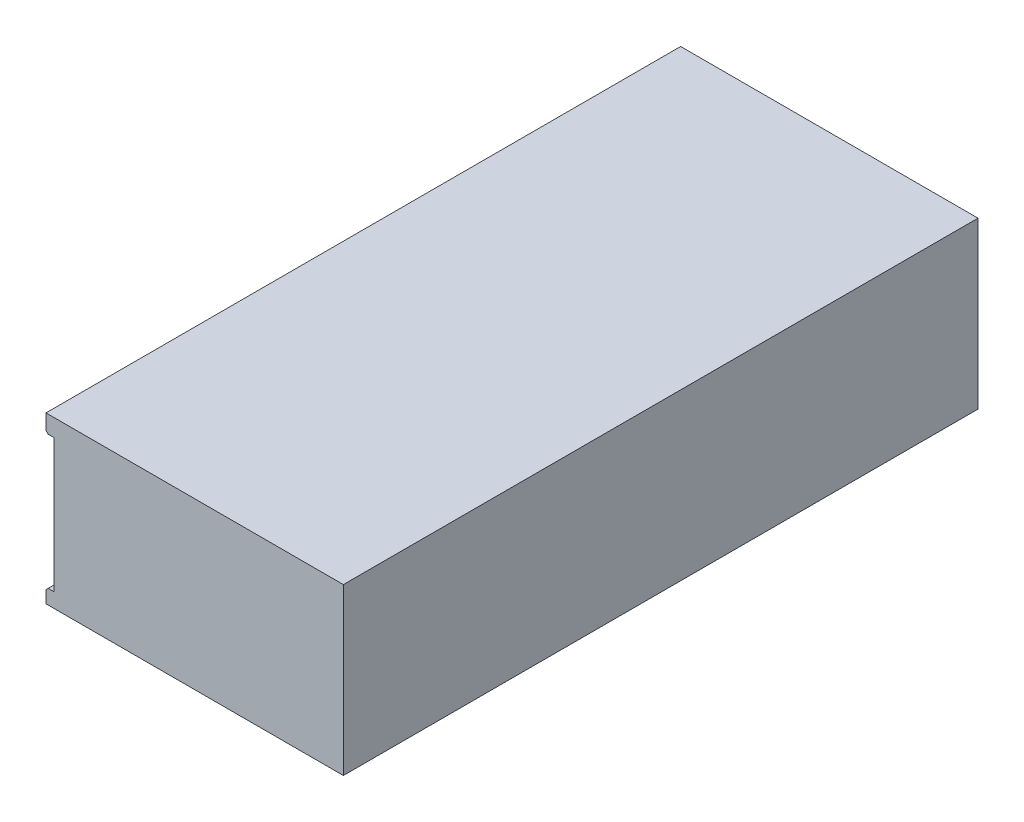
ISO-10303-21;
HEADER;
FILE_DESCRIPTION(('STEP AP214'),'2;1');
FILE_NAME('part.step','',(''),(''),'','','');
FILE_SCHEMA(('AUTOMOTIVE_DESIGN { 1 0 10303 214 1 1 1 1 }'));
ENDSEC;
DATA;
#1=APPLICATION_CONTEXT('core data for automotive mechanical design processes');
#2=APPLICATION_PROTOCOL_DEFINITION('international standard','automotive_design',2000,#1);
#3=PRODUCT_CONTEXT('',#1,'mechanical');
#4=PRODUCT('Part','Part','',(#3));
#5=PRODUCT_RELATED_PRODUCT_CATEGORY('part','',(#4));
#6=PRODUCT_DEFINITION_FORMATION('','',#4);
#7=PRODUCT_DEFINITION_CONTEXT('part definition',#1,'design');
#8=PRODUCT_DEFINITION('design','',#6,#7);
#9=PRODUCT_DEFINITION_SHAPE('','',#8);
#10=(LENGTH_UNIT() NAMED_UNIT(*) SI_UNIT(.MILLI.,.METRE.));
#11=(NAMED_UNIT(*) PLANE_ANGLE_UNIT() SI_UNIT($,.RADIAN.));
#12=(NAMED_UNIT(*) SI_UNIT($,.STERADIAN.) SOLID_ANGLE_UNIT());
#13=UNCERTAINTY_MEASURE_WITH_UNIT(LENGTH_MEASURE(1.E-05),#10,'distance_accuracy_value','');
#14=(GEOMETRIC_REPRESENTATION_CONTEXT(3) GLOBAL_UNCERTAINTY_ASSIGNED_CONTEXT((#13)) GLOBAL_UNIT_ASSIGNED_CONTEXT((#10,
#11,#12)) REPRESENTATION_CONTEXT('',''));
#15=CARTESIAN_POINT('',(0.,0.,0.));
#16=DIRECTION('',(0.,0.,1.));
#17=DIRECTION('',(1.,0.,0.));
#18=AXIS2_PLACEMENT_3D('',#15,#16,#17);
#19=CARTESIAN_POINT('',(-1.397,0.,55.5625));
#20=DIRECTION('',(0.,-1.,0.));
#21=DIRECTION('',(0.,0.,-1.));
#22=AXIS2_PLACEMENT_3D('',#19,#20,#21);
#23=PLANE('',#22);
#24=DIRECTION('',(-1.,0.,0.));
#25=VECTOR('',#24,1.);
#26=CARTESIAN_POINT('',(-1.397,0.,-55.5625));
#27=LINE('',#26,#25);
#28=CARTESIAN_POINT('',(50.673,0.,-55.5625));
#29=VERTEX_POINT('',#28);
#30=CARTESIAN_POINT('',(-1.397,0.,-55.5625));
#31=VERTEX_POINT('',#30);
#32=EDGE_CURVE('E240',#29,#31,#27,.T.);
#33=ORIENTED_EDGE('',*,*,#32,.T.);
#34=DIRECTION('',(0.,0.,-1.));
#35=VECTOR('',#34,1.);
#36=CARTESIAN_POINT('',(-1.397,0.,55.5625));
#37=LINE('',#36,#35);
#38=CARTESIAN_POINT('',(-1.397,0.,55.5625));
#39=VERTEX_POINT('',#38);
#40=EDGE_CURVE('E291',#39,#31,#37,.T.);
#41=ORIENTED_EDGE('',*,*,#40,.F.);
#42=DIRECTION('',(-1.,0.,0.));
#43=VECTOR('',#42,1.);
#44=CARTESIAN_POINT('',(-1.397,0.,55.5625));
#45=LINE('',#44,#43);
#46=CARTESIAN_POINT('',(50.673,0.,55.5625));
#47=VERTEX_POINT('',#46);
#48=EDGE_CURVE('E241',#47,#39,#45,.T.);
#49=ORIENTED_EDGE('',*,*,#48,.F.);
#50=DIRECTION('',(0.,0.,-1.));
#51=VECTOR('',#50,1.);
#52=CARTESIAN_POINT('',(50.673,0.,55.5625));
#53=LINE('',#52,#51);
#54=EDGE_CURVE('E260',#47,#29,#53,.T.);
#55=ORIENTED_EDGE('',*,*,#54,.T.);
#56=EDGE_LOOP('',(#33,#41,#49,#55));
#57=FACE_BOUND('',#56,.T.);
#58=ADVANCED_FACE('F37',(#57),#23,.F.);
#59=CARTESIAN_POINT('',(-1.397,-3.048,55.5625));
#60=DIRECTION('',(1.,0.,0.));
#61=DIRECTION('',(0.,0.,-1.));
#62=AXIS2_PLACEMENT_3D('',#59,#60,#61);
#63=PLANE('',#62);
#64=DIRECTION('',(0.,-1.,0.));
#65=VECTOR('',#64,1.);
#66=CARTESIAN_POINT('',(-1.397,-3.048,-55.5625));
#67=LINE('',#66,#65);
#68=CARTESIAN_POINT('',(-1.397,-2.66700000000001,-55.5625));
#69=VERTEX_POINT('',#68);
#70=EDGE_CURVE('E263',#31,#69,#67,.T.);
#71=ORIENTED_EDGE('',*,*,#70,.T.);
#72=DIRECTION('',(0.,0.,1.));
#73=VECTOR('',#72,1.);
#74=CARTESIAN_POINT('',(-1.397,-2.66700000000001,55.5625));
#75=LINE('',#74,#73);
#76=CARTESIAN_POINT('',(-1.397,-2.66700000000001,55.5625));
#77=VERTEX_POINT('',#76);
#78=EDGE_CURVE('E11',#69,#77,#75,.T.);
#79=ORIENTED_EDGE('',*,*,#78,.T.);
#80=DIRECTION('',(0.,-1.,0.));
#81=VECTOR('',#80,1.);
#82=CARTESIAN_POINT('',(-1.397,-3.048,55.5625));
#83=LINE('',#82,#81);
#84=EDGE_CURVE('E244',#39,#77,#83,.T.);
#85=ORIENTED_EDGE('',*,*,#84,.F.);
#86=ORIENTED_EDGE('',*,*,#40,.T.);
#87=EDGE_LOOP('',(#71,#79,#85,#86));
#88=FACE_BOUND('',#87,.T.);
#89=ADVANCED_FACE('F347',(#88),#63,.F.);
#90=CARTESIAN_POINT('',(0.,-3.048,55.5625));
#91=DIRECTION('',(0.,1.,0.));
#92=DIRECTION('',(0.,0.,1.));
#93=AXIS2_PLACEMENT_3D('',#90,#91,#92);
#94=PLANE('',#93);
#95=DIRECTION('',(1.,0.,0.));
#96=VECTOR('',#95,1.);
#97=CARTESIAN_POINT('',(0.,-3.048,55.5625));
#98=LINE('',#97,#96);
#99=CARTESIAN_POINT('',(-1.01600000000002,-3.048,55.5625));
#100=VERTEX_POINT('',#99);
#101=CARTESIAN_POINT('',(0.,-3.048,55.5625));
#102=VERTEX_POINT('',#101);
#103=EDGE_CURVE('E247',#100,#102,#98,.T.);
#104=ORIENTED_EDGE('',*,*,#103,.F.);
#105=DIRECTION('',(0.,0.,-1.));
#106=VECTOR('',#105,1.);
#107=CARTESIAN_POINT('',(-1.01600000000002,-3.048,55.5625));
#108=LINE('',#107,#106);
#109=CARTESIAN_POINT('',(-1.01600000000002,-3.048,-55.5625));
#110=VERTEX_POINT('',#109);
#111=EDGE_CURVE('E45',#100,#110,#108,.T.);
#112=ORIENTED_EDGE('',*,*,#111,.T.);
#113=DIRECTION('',(1.,0.,0.));
#114=VECTOR('',#113,1.);
#115=CARTESIAN_POINT('',(0.,-3.048,-55.5625));
#116=LINE('',#115,#114);
#117=CARTESIAN_POINT('',(0.,-3.048,-55.5625));
#118=VERTEX_POINT('',#117);
#119=EDGE_CURVE('E265',#110,#118,#116,.T.);
#120=ORIENTED_EDGE('',*,*,#119,.T.);
#121=DIRECTION('',(0.,0.,-1.));
#122=VECTOR('',#121,1.);
#123=CARTESIAN_POINT('',(0.,-3.048,55.5625));
#124=LINE('',#123,#122);
#125=EDGE_CURVE('E288',#102,#118,#124,.T.);
#126=ORIENTED_EDGE('',*,*,#125,.F.);
#127=EDGE_LOOP('',(#104,#112,#120,#126));
#128=FACE_BOUND('',#127,.T.);
#129=ADVANCED_FACE('F309',(#128),#94,.F.);
#130=CARTESIAN_POINT('',(0.,-26.416,55.5625));
#131=DIRECTION('',(1.,0.,0.));
#132=DIRECTION('',(0.,0.,-1.));
#133=AXIS2_PLACEMENT_3D('',#130,#131,#132);
#134=PLANE('',#133);
#135=CARTESIAN_POINT('',(0.,-6.34999999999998,-50.2666));
#136=DIRECTION('',(-1.,0.,0.));
#137=DIRECTION('',(0.,0.,1.));
#138=AXIS2_PLACEMENT_3D('',#135,#136,#137);
#139=CIRCLE('',#138,2.413);
#140=CARTESIAN_POINT('',(0.,-6.34999999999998,-47.8536));
#141=VERTEX_POINT('',#140);
#142=EDGE_CURVE('E153',#141,#141,#139,.T.);
#143=ORIENTED_EDGE('',*,*,#142,.F.);
#144=EDGE_LOOP('',(#143));
#145=FACE_BOUND('',#144,.T.);
#146=CARTESIAN_POINT('',(0.,-6.35000000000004,50.2666));
#147=DIRECTION('',(-1.,0.,0.));
#148=DIRECTION('',(0.,0.,1.));
#149=AXIS2_PLACEMENT_3D('',#146,#147,#148);
#150=CIRCLE('',#149,2.413);
#151=CARTESIAN_POINT('',(0.,-6.35000000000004,52.6796));
#152=VERTEX_POINT('',#151);
#153=EDGE_CURVE('E165',#152,#152,#150,.T.);
#154=ORIENTED_EDGE('',*,*,#153,.F.);
#155=EDGE_LOOP('',(#154));
#156=FACE_BOUND('',#155,.T.);
#157=CARTESIAN_POINT('',(0.,-6.35000000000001,4.8768));
#158=DIRECTION('',(-1.,0.,0.));
#159=DIRECTION('',(0.,0.,1.));
#160=AXIS2_PLACEMENT_3D('',#157,#158,#159);
#161=CIRCLE('',#160,2.413);
#162=CARTESIAN_POINT('',(0.,-6.35000000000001,7.28979999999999));
#163=VERTEX_POINT('',#162);
#164=EDGE_CURVE('E177',#163,#163,#161,.T.);
#165=ORIENTED_EDGE('',*,*,#164,.F.);
#166=EDGE_LOOP('',(#165));
#167=FACE_BOUND('',#166,.T.);
#168=CARTESIAN_POINT('',(0.,-6.35000000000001,-4.8768));
#169=DIRECTION('',(-1.,0.,0.));
#170=DIRECTION('',(0.,0.,1.));
#171=AXIS2_PLACEMENT_3D('',#168,#169,#170);
#172=CIRCLE('',#171,2.413);
#173=CARTESIAN_POINT('',(0.,-6.35000000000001,-2.4638));
#174=VERTEX_POINT('',#173);
#175=EDGE_CURVE('E189',#174,#174,#172,.T.);
#176=ORIENTED_EDGE('',*,*,#175,.F.);
#177=EDGE_LOOP('',(#176));
#178=FACE_BOUND('',#177,.T.);
#179=CARTESIAN_POINT('',(0.,-23.114,-50.2666));
#180=DIRECTION('',(-1.,0.,0.));
#181=DIRECTION('',(0.,0.,1.));
#182=AXIS2_PLACEMENT_3D('',#179,#180,#181);
#183=CIRCLE('',#182,2.413);
#184=CARTESIAN_POINT('',(0.,-23.114,-47.8536));
#185=VERTEX_POINT('',#184);
#186=EDGE_CURVE('E201',#185,#185,#183,.T.);
#187=ORIENTED_EDGE('',*,*,#186,.F.);
#188=EDGE_LOOP('',(#187));
#189=FACE_BOUND('',#188,.T.);
#190=CARTESIAN_POINT('',(0.,-23.114,-4.87680000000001));
#191=DIRECTION('',(-1.,0.,0.));
#192=DIRECTION('',(0.,0.,1.));
#193=AXIS2_PLACEMENT_3D('',#190,#191,#192);
#194=CIRCLE('',#193,2.413);
#195=CARTESIAN_POINT('',(0.,-23.114,-2.46380000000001));
#196=VERTEX_POINT('',#195);
#197=EDGE_CURVE('E213',#196,#196,#194,.T.);
#198=ORIENTED_EDGE('',*,*,#197,.F.);
#199=EDGE_LOOP('',(#198));
#200=FACE_BOUND('',#199,.T.);
#201=CARTESIAN_POINT('',(0.,-23.114,4.87679999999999));
#202=DIRECTION('',(-1.,0.,0.));
#203=DIRECTION('',(0.,0.,1.));
#204=AXIS2_PLACEMENT_3D('',#201,#202,#203);
#205=CIRCLE('',#204,2.413);
#206=CARTESIAN_POINT('',(0.,-23.114,7.28979999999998));
#207=VERTEX_POINT('',#206);
#208=EDGE_CURVE('E225',#207,#207,#205,.T.);
#209=ORIENTED_EDGE('',*,*,#208,.F.);
#210=EDGE_LOOP('',(#209));
#211=FACE_BOUND('',#210,.T.);
#212=CARTESIAN_POINT('',(0.,-23.114,50.2666));
#213=DIRECTION('',(-1.,0.,0.));
#214=DIRECTION('',(0.,0.,1.));
#215=AXIS2_PLACEMENT_3D('',#212,#213,#214);
#216=CIRCLE('',#215,2.413);
#217=CARTESIAN_POINT('',(0.,-23.114,52.6796));
#218=VERTEX_POINT('',#217);
#219=EDGE_CURVE('E237',#218,#218,#216,.T.);
#220=ORIENTED_EDGE('',*,*,#219,.F.);
#221=EDGE_LOOP('',(#220));
#222=FACE_BOUND('',#221,.T.);
#223=DIRECTION('',(0.,-1.,0.));
#224=VECTOR('',#223,1.);
#225=CARTESIAN_POINT('',(0.,-26.416,-55.5625));
#226=LINE('',#225,#224);
#227=CARTESIAN_POINT('',(0.,-26.416,-55.5625));
#228=VERTEX_POINT('',#227);
#229=EDGE_CURVE('E267',#118,#228,#226,.T.);
#230=ORIENTED_EDGE('',*,*,#229,.T.);
#231=DIRECTION('',(0.,0.,-1.));
#232=VECTOR('',#231,1.);
#233=CARTESIAN_POINT('',(0.,-26.416,55.5625));
#234=LINE('',#233,#232);
#235=CARTESIAN_POINT('',(0.,-26.416,55.5625));
#236=VERTEX_POINT('',#235);
#237=EDGE_CURVE('E285',#236,#228,#234,.T.);
#238=ORIENTED_EDGE('',*,*,#237,.F.);
#239=DIRECTION('',(0.,-1.,0.));
#240=VECTOR('',#239,1.);
#241=CARTESIAN_POINT('',(0.,-26.416,55.5625));
#242=LINE('',#241,#240);
#243=EDGE_CURVE('E249',#102,#236,#242,.T.);
#244=ORIENTED_EDGE('',*,*,#243,.F.);
#245=ORIENTED_EDGE('',*,*,#125,.T.);
#246=EDGE_LOOP('',(#230,#238,#244,#245));
#247=FACE_BOUND('',#246,.T.);
#248=ADVANCED_FACE('F319',(#145,#156,#167,#178,#189,#200,#211,#222,#247),#134,.F.);
#249=CARTESIAN_POINT('',(-1.397,-26.416,55.5625));
#250=DIRECTION('',(0.,-1.,0.));
#251=DIRECTION('',(0.,0.,-1.));
#252=AXIS2_PLACEMENT_3D('',#249,#250,#251);
#253=PLANE('',#252);
#254=DIRECTION('',(-1.,0.,0.));
#255=VECTOR('',#254,1.);
#256=CARTESIAN_POINT('',(-1.397,-26.416,-55.5625));
#257=LINE('',#256,#255);
#258=CARTESIAN_POINT('',(-1.01599999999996,-26.416,-55.5625));
#259=VERTEX_POINT('',#258);
#260=EDGE_CURVE('E269',#228,#259,#257,.T.);
#261=ORIENTED_EDGE('',*,*,#260,.T.);
#262=DIRECTION('',(0.,0.,1.));
#263=VECTOR('',#262,1.);
#264=CARTESIAN_POINT('',(-1.01599999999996,-26.416,55.5625));
#265=LINE('',#264,#263);
#266=CARTESIAN_POINT('',(-1.01599999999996,-26.416,55.5625));
#267=VERTEX_POINT('',#266);
#268=EDGE_CURVE('E301',#259,#267,#265,.T.);
#269=ORIENTED_EDGE('',*,*,#268,.T.);
#270=DIRECTION('',(-1.,0.,0.));
#271=VECTOR('',#270,1.);
#272=CARTESIAN_POINT('',(-1.397,-26.416,55.5625));
#273=LINE('',#272,#271);
#274=EDGE_CURVE('E251',#236,#267,#273,.T.);
#275=ORIENTED_EDGE('',*,*,#274,.F.);
#276=ORIENTED_EDGE('',*,*,#237,.T.);
#277=EDGE_LOOP('',(#261,#269,#275,#276));
#278=FACE_BOUND('',#277,.T.);
#279=ADVANCED_FACE('F323',(#278),#253,.F.);
#280=CARTESIAN_POINT('',(-1.397,-28.956,55.5625));
#281=DIRECTION('',(1.,0.,0.));
#282=DIRECTION('',(0.,1.,0.));
#283=AXIS2_PLACEMENT_3D('',#280,#281,#282);
#284=PLANE('',#283);
#285=DIRECTION('',(0.,-1.,0.));
#286=VECTOR('',#285,1.);
#287=CARTESIAN_POINT('',(-1.397,-28.956,55.5625));
#288=LINE('',#287,#286);
#289=CARTESIAN_POINT('',(-1.397,-26.797,55.5625));
#290=VERTEX_POINT('',#289);
#291=CARTESIAN_POINT('',(-1.397,-28.956,55.5625));
#292=VERTEX_POINT('',#291);
#293=EDGE_CURVE('E254',#290,#292,#288,.T.);
#294=ORIENTED_EDGE('',*,*,#293,.F.);
#295=DIRECTION('',(0.,0.,-1.));
#296=VECTOR('',#295,1.);
#297=CARTESIAN_POINT('',(-1.397,-26.797,55.5625));
#298=LINE('',#297,#296);
#299=CARTESIAN_POINT('',(-1.397,-26.797,-55.5625));
#300=VERTEX_POINT('',#299);
#301=EDGE_CURVE('E294',#290,#300,#298,.T.);
#302=ORIENTED_EDGE('',*,*,#301,.T.);
#303=DIRECTION('',(0.,-1.,0.));
#304=VECTOR('',#303,1.);
#305=CARTESIAN_POINT('',(-1.397,-28.956,-55.5625));
#306=LINE('',#305,#304);
#307=CARTESIAN_POINT('',(-1.397,-28.956,-55.5625));
#308=VERTEX_POINT('',#307);
#309=EDGE_CURVE('E272',#300,#308,#306,.T.);
#310=ORIENTED_EDGE('',*,*,#309,.T.);
#311=DIRECTION('',(0.,0.,-1.));
#312=VECTOR('',#311,1.);
#313=CARTESIAN_POINT('',(-1.397,-28.956,55.5625));
#314=LINE('',#313,#312);
#315=EDGE_CURVE('E282',#292,#308,#314,.T.);
#316=ORIENTED_EDGE('',*,*,#315,.F.);
#317=EDGE_LOOP('',(#294,#302,#310,#316));
#318=FACE_BOUND('',#317,.T.);
#319=ADVANCED_FACE('F331',(#318),#284,.F.);
#320=CARTESIAN_POINT('',(50.673,-28.956,55.5625));
#321=DIRECTION('',(0.,1.,0.));
#322=DIRECTION('',(-1.,0.,0.));
#323=AXIS2_PLACEMENT_3D('',#320,#321,#322);
#324=PLANE('',#323);
#325=DIRECTION('',(1.,0.,0.));
#326=VECTOR('',#325,1.);
#327=CARTESIAN_POINT('',(50.673,-28.956,-55.5625));
#328=LINE('',#327,#326);
#329=CARTESIAN_POINT('',(50.673,-28.956,-55.5625));
#330=VERTEX_POINT('',#329);
#331=EDGE_CURVE('E274',#308,#330,#328,.T.);
#332=ORIENTED_EDGE('',*,*,#331,.T.);
#333=DIRECTION('',(0.,0.,-1.));
#334=VECTOR('',#333,1.);
#335=CARTESIAN_POINT('',(50.673,-28.956,55.5625));
#336=LINE('',#335,#334);
#337=CARTESIAN_POINT('',(50.673,-28.956,55.5625));
#338=VERTEX_POINT('',#337);
#339=EDGE_CURVE('E279',#338,#330,#336,.T.);
#340=ORIENTED_EDGE('',*,*,#339,.F.);
#341=DIRECTION('',(1.,0.,0.));
#342=VECTOR('',#341,1.);
#343=CARTESIAN_POINT('',(50.673,-28.956,55.5625));
#344=LINE('',#343,#342);
#345=EDGE_CURVE('E256',#292,#338,#344,.T.);
#346=ORIENTED_EDGE('',*,*,#345,.F.);
#347=ORIENTED_EDGE('',*,*,#315,.T.);
#348=EDGE_LOOP('',(#332,#340,#346,#347));
#349=FACE_BOUND('',#348,.T.);
#350=ADVANCED_FACE('F338',(#349),#324,.F.);
#351=CARTESIAN_POINT('',(50.673,0.,55.5625));
#352=DIRECTION('',(-1.,0.,0.));
#353=DIRECTION('',(0.,0.,1.));
#354=AXIS2_PLACEMENT_3D('',#351,#352,#353);
#355=PLANE('',#354);
#356=DIRECTION('',(0.,1.,0.));
#357=VECTOR('',#356,1.);
#358=CARTESIAN_POINT('',(50.673,0.,-55.5625));
#359=LINE('',#358,#357);
#360=EDGE_CURVE('E245',#330,#29,#359,.T.);
#361=ORIENTED_EDGE('',*,*,#360,.T.);
#362=ORIENTED_EDGE('',*,*,#54,.F.);
#363=DIRECTION('',(0.,1.,0.));
#364=VECTOR('',#363,1.);
#365=CARTESIAN_POINT('',(50.673,0.,55.5625));
#366=LINE('',#365,#364);
#367=EDGE_CURVE('E258',#338,#47,#366,.T.);
#368=ORIENTED_EDGE('',*,*,#367,.F.);
#369=ORIENTED_EDGE('',*,*,#339,.T.);
#370=EDGE_LOOP('',(#361,#362,#368,#369));
#371=FACE_BOUND('',#370,.T.);
#372=ADVANCED_FACE('F342',(#371),#355,.F.);
#373=CARTESIAN_POINT('',(50.673,0.,55.5625));
#374=DIRECTION('',(0.,0.,-1.));
#375=DIRECTION('',(-1.,0.,0.));
#376=AXIS2_PLACEMENT_3D('',#373,#374,#375);
#377=PLANE('',#376);
#378=ORIENTED_EDGE('',*,*,#274,.T.);
#379=DIRECTION('',(0.70710678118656,0.707106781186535,0.));
#380=VECTOR('',#379,1.);
#381=CARTESIAN_POINT('',(-1.397,-26.797,55.5625));
#382=LINE('',#381,#380);
#383=EDGE_CURVE('E304',#267,#290,#382,.F.);
#384=ORIENTED_EDGE('',*,*,#383,.T.);
#385=ORIENTED_EDGE('',*,*,#293,.T.);
#386=ORIENTED_EDGE('',*,*,#345,.T.);
#387=ORIENTED_EDGE('',*,*,#367,.T.);
#388=ORIENTED_EDGE('',*,*,#48,.T.);
#389=ORIENTED_EDGE('',*,*,#84,.T.);
#390=DIRECTION('',(-0.707106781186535,0.70710678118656,0.));
#391=VECTOR('',#390,1.);
#392=CARTESIAN_POINT('',(-1.01600000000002,-3.048,55.5625));
#393=LINE('',#392,#391);
#394=EDGE_CURVE('E52',#77,#100,#393,.F.);
#395=ORIENTED_EDGE('',*,*,#394,.T.);
#396=ORIENTED_EDGE('',*,*,#103,.T.);
#397=ORIENTED_EDGE('',*,*,#243,.T.);
#398=EDGE_LOOP('',(#378,#384,#385,#386,#387,#388,#389,#395,#396,#397));
#399=FACE_BOUND('',#398,.T.);
#400=ADVANCED_FACE('F326',(#399),#377,.F.);
#401=CARTESIAN_POINT('',(50.673,0.,-55.5625));
#402=DIRECTION('',(0.,0.,-1.));
#403=DIRECTION('',(-1.,0.,0.));
#404=AXIS2_PLACEMENT_3D('',#401,#402,#403);
#405=PLANE('',#404);
#406=ORIENTED_EDGE('',*,*,#309,.F.);
#407=DIRECTION('',(-0.70710678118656,-0.707106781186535,0.));
#408=VECTOR('',#407,1.);
#409=CARTESIAN_POINT('',(38.036500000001,12.6364999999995,-55.5625));
#410=LINE('',#409,#408);
#411=EDGE_CURVE('E299',#300,#259,#410,.F.);
#412=ORIENTED_EDGE('',*,*,#411,.T.);
#413=ORIENTED_EDGE('',*,*,#260,.F.);
#414=ORIENTED_EDGE('',*,*,#229,.F.);
#415=ORIENTED_EDGE('',*,*,#119,.F.);
#416=DIRECTION('',(0.707106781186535,-0.70710678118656,0.));
#417=VECTOR('',#416,1.);
#418=CARTESIAN_POINT('',(23.3044999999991,-27.3684999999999,-55.5625));
#419=LINE('',#418,#417);
#420=EDGE_CURVE('E297',#110,#69,#419,.F.);
#421=ORIENTED_EDGE('',*,*,#420,.T.);
#422=ORIENTED_EDGE('',*,*,#70,.F.);
#423=ORIENTED_EDGE('',*,*,#32,.F.);
#424=ORIENTED_EDGE('',*,*,#360,.F.);
#425=ORIENTED_EDGE('',*,*,#331,.F.);
#426=EDGE_LOOP('',(#406,#412,#413,#414,#415,#421,#422,#423,#424,#425));
#427=FACE_BOUND('',#426,.T.);
#428=ADVANCED_FACE('F315',(#427),#405,.T.);
#429=CARTESIAN_POINT('',(0.,-23.114,50.2666));
#430=DIRECTION('',(-1.,0.,0.));
#431=DIRECTION('',(0.,0.,1.));
#432=AXIS2_PLACEMENT_3D('',#429,#430,#431);
#433=CYLINDRICAL_SURFACE('',#432,2.413);
#434=CARTESIAN_POINT('',(7.62000000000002,-23.114,50.2666));
#435=DIRECTION('',(-1.,0.,0.));
#436=DIRECTION('',(0.,0.,1.));
#437=AXIS2_PLACEMENT_3D('',#434,#435,#436);
#438=CIRCLE('',#437,2.413);
#439=CARTESIAN_POINT('',(7.62000000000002,-23.114,52.6796));
#440=VERTEX_POINT('',#439);
#441=EDGE_CURVE('E234',#440,#440,#438,.T.);
#442=ORIENTED_EDGE('',*,*,#441,.F.);
#443=EDGE_LOOP('',(#442));
#444=FACE_BOUND('',#443,.T.);
#445=ORIENTED_EDGE('',*,*,#219,.T.);
#446=EDGE_LOOP('',(#445));
#447=FACE_BOUND('',#446,.T.);
#448=ADVANCED_FACE('F374',(#444,#447),#433,.F.);
#449=CARTESIAN_POINT('',(7.62000000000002,-21.0947,50.2666));
#450=DIRECTION('',(1.,0.,0.));
#451=DIRECTION('',(0.,0.,-1.));
#452=AXIS2_PLACEMENT_3D('',#449,#450,#451);
#453=PLANE('',#452);
#454=CARTESIAN_POINT('',(7.62000000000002,-23.114,50.2666));
#455=DIRECTION('',(-1.,0.,0.));
#456=DIRECTION('',(0.,0.,1.));
#457=AXIS2_PLACEMENT_3D('',#454,#455,#456);
#458=CIRCLE('',#457,2.0193);
#459=CARTESIAN_POINT('',(7.62000000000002,-23.114,52.2859));
#460=VERTEX_POINT('',#459);
#461=EDGE_CURVE('E231',#460,#460,#458,.T.);
#462=ORIENTED_EDGE('',*,*,#461,.F.);
#463=EDGE_LOOP('',(#462));
#464=FACE_BOUND('',#463,.T.);
#465=ORIENTED_EDGE('',*,*,#441,.T.);
#466=EDGE_LOOP('',(#465));
#467=FACE_BOUND('',#466,.T.);
#468=ADVANCED_FACE('F379',(#464,#467),#453,.F.);
#469=CARTESIAN_POINT('',(0.,-23.114,50.2666));
#470=DIRECTION('',(-1.,0.,0.));
#471=DIRECTION('',(0.,0.,1.));
#472=AXIS2_PLACEMENT_3D('',#469,#470,#471);
#473=CYLINDRICAL_SURFACE('',#472,2.0193);
#474=CARTESIAN_POINT('',(9.99744000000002,-23.114,50.2666));
#475=DIRECTION('',(-1.,0.,0.));
#476=DIRECTION('',(0.,0.,1.));
#477=AXIS2_PLACEMENT_3D('',#474,#475,#476);
#478=CIRCLE('',#477,2.0193);
#479=CARTESIAN_POINT('',(9.99744000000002,-23.114,52.2859));
#480=VERTEX_POINT('',#479);
#481=EDGE_CURVE('E228',#480,#480,#478,.T.);
#482=ORIENTED_EDGE('',*,*,#481,.F.);
#483=EDGE_LOOP('',(#482));
#484=FACE_BOUND('',#483,.T.);
#485=ORIENTED_EDGE('',*,*,#461,.T.);
#486=EDGE_LOOP('',(#485));
#487=FACE_BOUND('',#486,.T.);
#488=ADVANCED_FACE('F383',(#484,#487),#473,.F.);
#489=CARTESIAN_POINT('',(9.99744000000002,-23.114,50.2666));
#490=DIRECTION('',(-1.,0.,0.));
#491=DIRECTION('',(0.,0.,1.));
#492=AXIS2_PLACEMENT_3D('',#489,#490,#491);
#493=CONICAL_SURFACE('',#492,2.0193,1.02974425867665);
#494=CARTESIAN_POINT('',(11.2107578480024,-23.114,50.2666));
#495=VERTEX_POINT('',#494);
#496=VERTEX_LOOP('',#495);
#497=FACE_BOUND('',#496,.T.);
#498=ORIENTED_EDGE('',*,*,#481,.T.);
#499=EDGE_LOOP('',(#498));
#500=FACE_BOUND('',#499,.T.);
#501=ADVANCED_FACE('F387',(#497,#500),#493,.F.);
#502=CARTESIAN_POINT('',(0.,-23.114,4.87679999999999));
#503=DIRECTION('',(-1.,0.,0.));
#504=DIRECTION('',(0.,0.,1.));
#505=AXIS2_PLACEMENT_3D('',#502,#503,#504);
#506=CYLINDRICAL_SURFACE('',#505,2.413);
#507=CARTESIAN_POINT('',(7.62000000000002,-23.114,4.87679999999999));
#508=DIRECTION('',(-1.,0.,0.));
#509=DIRECTION('',(0.,0.,1.));
#510=AXIS2_PLACEMENT_3D('',#507,#508,#509);
#511=CIRCLE('',#510,2.413);
#512=CARTESIAN_POINT('',(7.62000000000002,-23.114,7.28979999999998));
#513=VERTEX_POINT('',#512);
#514=EDGE_CURVE('E222',#513,#513,#511,.T.);
#515=ORIENTED_EDGE('',*,*,#514,.F.);
#516=EDGE_LOOP('',(#515));
#517=FACE_BOUND('',#516,.T.);
#518=ORIENTED_EDGE('',*,*,#208,.T.);
#519=EDGE_LOOP('',(#518));
#520=FACE_BOUND('',#519,.T.);
#521=ADVANCED_FACE('F391',(#517,#520),#506,.F.);
#522=CARTESIAN_POINT('',(7.62000000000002,-21.0947,4.87679999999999));
#523=DIRECTION('',(1.,0.,0.));
#524=DIRECTION('',(0.,0.,-1.));
#525=AXIS2_PLACEMENT_3D('',#522,#523,#524);
#526=PLANE('',#525);
#527=CARTESIAN_POINT('',(7.62000000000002,-23.114,4.87679999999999));
#528=DIRECTION('',(-1.,0.,0.));
#529=DIRECTION('',(0.,0.,1.));
#530=AXIS2_PLACEMENT_3D('',#527,#528,#529);
#531=CIRCLE('',#530,2.0193);
#532=CARTESIAN_POINT('',(7.62000000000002,-23.114,6.89609999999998));
#533=VERTEX_POINT('',#532);
#534=EDGE_CURVE('E219',#533,#533,#531,.T.);
#535=ORIENTED_EDGE('',*,*,#534,.F.);
#536=EDGE_LOOP('',(#535));
#537=FACE_BOUND('',#536,.T.);
#538=ORIENTED_EDGE('',*,*,#514,.T.);
#539=EDGE_LOOP('',(#538));
#540=FACE_BOUND('',#539,.T.);
#541=ADVANCED_FACE('F395',(#537,#540),#526,.F.);
#542=CARTESIAN_POINT('',(0.,-23.114,4.87679999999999));
#543=DIRECTION('',(-1.,0.,0.));
#544=DIRECTION('',(0.,0.,1.));
#545=AXIS2_PLACEMENT_3D('',#542,#543,#544);
#546=CYLINDRICAL_SURFACE('',#545,2.0193);
#547=CARTESIAN_POINT('',(9.99744000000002,-23.114,4.87679999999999));
#548=DIRECTION('',(-1.,0.,0.));
#549=DIRECTION('',(0.,0.,1.));
#550=AXIS2_PLACEMENT_3D('',#547,#548,#549);
#551=CIRCLE('',#550,2.0193);
#552=CARTESIAN_POINT('',(9.99744000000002,-23.114,6.89609999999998));
#553=VERTEX_POINT('',#552);
#554=EDGE_CURVE('E216',#553,#553,#551,.T.);
#555=ORIENTED_EDGE('',*,*,#554,.F.);
#556=EDGE_LOOP('',(#555));
#557=FACE_BOUND('',#556,.T.);
#558=ORIENTED_EDGE('',*,*,#534,.T.);
#559=EDGE_LOOP('',(#558));
#560=FACE_BOUND('',#559,.T.);
#561=ADVANCED_FACE('F399',(#557,#560),#546,.F.);
#562=CARTESIAN_POINT('',(9.99744000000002,-23.114,4.87679999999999));
#563=DIRECTION('',(-1.,0.,0.));
#564=DIRECTION('',(0.,0.,1.));
#565=AXIS2_PLACEMENT_3D('',#562,#563,#564);
#566=CONICAL_SURFACE('',#565,2.0193,1.02974425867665);
#567=CARTESIAN_POINT('',(11.2107578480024,-23.114,4.87679999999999));
#568=VERTEX_POINT('',#567);
#569=VERTEX_LOOP('',#568);
#570=FACE_BOUND('',#569,.T.);
#571=ORIENTED_EDGE('',*,*,#554,.T.);
#572=EDGE_LOOP('',(#571));
#573=FACE_BOUND('',#572,.T.);
#574=ADVANCED_FACE('F403',(#570,#573),#566,.F.);
#575=CARTESIAN_POINT('',(0.,-23.114,-4.87680000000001));
#576=DIRECTION('',(-1.,0.,0.));
#577=DIRECTION('',(0.,0.,1.));
#578=AXIS2_PLACEMENT_3D('',#575,#576,#577);
#579=CYLINDRICAL_SURFACE('',#578,2.413);
#580=CARTESIAN_POINT('',(7.62000000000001,-23.114,-4.87680000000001));
#581=DIRECTION('',(-1.,0.,0.));
#582=DIRECTION('',(0.,0.,1.));
#583=AXIS2_PLACEMENT_3D('',#580,#581,#582);
#584=CIRCLE('',#583,2.413);
#585=CARTESIAN_POINT('',(7.62000000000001,-23.114,-2.46380000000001));
#586=VERTEX_POINT('',#585);
#587=EDGE_CURVE('E210',#586,#586,#584,.T.);
#588=ORIENTED_EDGE('',*,*,#587,.F.);
#589=EDGE_LOOP('',(#588));
#590=FACE_BOUND('',#589,.T.);
#591=ORIENTED_EDGE('',*,*,#197,.T.);
#592=EDGE_LOOP('',(#591));
#593=FACE_BOUND('',#592,.T.);
#594=ADVANCED_FACE('F407',(#590,#593),#579,.F.);
#595=CARTESIAN_POINT('',(7.62000000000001,-21.0947,-4.87680000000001));
#596=DIRECTION('',(1.,0.,0.));
#597=DIRECTION('',(0.,0.,-1.));
#598=AXIS2_PLACEMENT_3D('',#595,#596,#597);
#599=PLANE('',#598);
#600=CARTESIAN_POINT('',(7.62000000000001,-23.114,-4.87680000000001));
#601=DIRECTION('',(-1.,0.,0.));
#602=DIRECTION('',(0.,0.,1.));
#603=AXIS2_PLACEMENT_3D('',#600,#601,#602);
#604=CIRCLE('',#603,2.0193);
#605=CARTESIAN_POINT('',(7.62000000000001,-23.114,-2.85750000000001));
#606=VERTEX_POINT('',#605);
#607=EDGE_CURVE('E207',#606,#606,#604,.T.);
#608=ORIENTED_EDGE('',*,*,#607,.F.);
#609=EDGE_LOOP('',(#608));
#610=FACE_BOUND('',#609,.T.);
#611=ORIENTED_EDGE('',*,*,#587,.T.);
#612=EDGE_LOOP('',(#611));
#613=FACE_BOUND('',#612,.T.);
#614=ADVANCED_FACE('F411',(#610,#613),#599,.F.);
#615=CARTESIAN_POINT('',(0.,-23.114,-4.87680000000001));
#616=DIRECTION('',(-1.,0.,0.));
#617=DIRECTION('',(0.,0.,1.));
#618=AXIS2_PLACEMENT_3D('',#615,#616,#617);
#619=CYLINDRICAL_SURFACE('',#618,2.0193);
#620=CARTESIAN_POINT('',(9.99744000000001,-23.114,-4.87680000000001));
#621=DIRECTION('',(-1.,0.,0.));
#622=DIRECTION('',(0.,0.,1.));
#623=AXIS2_PLACEMENT_3D('',#620,#621,#622);
#624=CIRCLE('',#623,2.0193);
#625=CARTESIAN_POINT('',(9.99744000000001,-23.114,-2.85750000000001));
#626=VERTEX_POINT('',#625);
#627=EDGE_CURVE('E204',#626,#626,#624,.T.);
#628=ORIENTED_EDGE('',*,*,#627,.F.);
#629=EDGE_LOOP('',(#628));
#630=FACE_BOUND('',#629,.T.);
#631=ORIENTED_EDGE('',*,*,#607,.T.);
#632=EDGE_LOOP('',(#631));
#633=FACE_BOUND('',#632,.T.);
#634=ADVANCED_FACE('F415',(#630,#633),#619,.F.);
#635=CARTESIAN_POINT('',(9.99744000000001,-23.114,-4.87680000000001));
#636=DIRECTION('',(-1.,0.,0.));
#637=DIRECTION('',(0.,0.,1.));
#638=AXIS2_PLACEMENT_3D('',#635,#636,#637);
#639=CONICAL_SURFACE('',#638,2.0193,1.02974425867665);
#640=CARTESIAN_POINT('',(11.2107578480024,-23.114,-4.87680000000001));
#641=VERTEX_POINT('',#640);
#642=VERTEX_LOOP('',#641);
#643=FACE_BOUND('',#642,.T.);
#644=ORIENTED_EDGE('',*,*,#627,.T.);
#645=EDGE_LOOP('',(#644));
#646=FACE_BOUND('',#645,.T.);
#647=ADVANCED_FACE('F419',(#643,#646),#639,.F.);
#648=CARTESIAN_POINT('',(0.,-23.114,-50.2666));
#649=DIRECTION('',(-1.,0.,0.));
#650=DIRECTION('',(0.,0.,1.));
#651=AXIS2_PLACEMENT_3D('',#648,#649,#650);
#652=CYLINDRICAL_SURFACE('',#651,2.413);
#653=CARTESIAN_POINT('',(7.62000000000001,-23.114,-50.2666));
#654=DIRECTION('',(-1.,0.,0.));
#655=DIRECTION('',(0.,0.,1.));
#656=AXIS2_PLACEMENT_3D('',#653,#654,#655);
#657=CIRCLE('',#656,2.413);
#658=CARTESIAN_POINT('',(7.62000000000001,-23.114,-47.8536));
#659=VERTEX_POINT('',#658);
#660=EDGE_CURVE('E198',#659,#659,#657,.T.);
#661=ORIENTED_EDGE('',*,*,#660,.F.);
#662=EDGE_LOOP('',(#661));
#663=FACE_BOUND('',#662,.T.);
#664=ORIENTED_EDGE('',*,*,#186,.T.);
#665=EDGE_LOOP('',(#664));
#666=FACE_BOUND('',#665,.T.);
#667=ADVANCED_FACE('F423',(#663,#666),#652,.F.);
#668=CARTESIAN_POINT('',(7.62000000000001,-21.0947,-50.2666));
#669=DIRECTION('',(1.,0.,0.));
#670=DIRECTION('',(0.,0.,-1.));
#671=AXIS2_PLACEMENT_3D('',#668,#669,#670);
#672=PLANE('',#671);
#673=CARTESIAN_POINT('',(7.62000000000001,-23.114,-50.2666));
#674=DIRECTION('',(-1.,0.,0.));
#675=DIRECTION('',(0.,0.,1.));
#676=AXIS2_PLACEMENT_3D('',#673,#674,#675);
#677=CIRCLE('',#676,2.0193);
#678=CARTESIAN_POINT('',(7.62000000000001,-23.114,-48.2473));
#679=VERTEX_POINT('',#678);
#680=EDGE_CURVE('E195',#679,#679,#677,.T.);
#681=ORIENTED_EDGE('',*,*,#680,.F.);
#682=EDGE_LOOP('',(#681));
#683=FACE_BOUND('',#682,.T.);
#684=ORIENTED_EDGE('',*,*,#660,.T.);
#685=EDGE_LOOP('',(#684));
#686=FACE_BOUND('',#685,.T.);
#687=ADVANCED_FACE('F427',(#683,#686),#672,.F.);
#688=CARTESIAN_POINT('',(0.,-23.114,-50.2666));
#689=DIRECTION('',(-1.,0.,0.));
#690=DIRECTION('',(0.,0.,1.));
#691=AXIS2_PLACEMENT_3D('',#688,#689,#690);
#692=CYLINDRICAL_SURFACE('',#691,2.0193);
#693=CARTESIAN_POINT('',(9.99744000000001,-23.114,-50.2666));
#694=DIRECTION('',(-1.,0.,0.));
#695=DIRECTION('',(0.,0.,1.));
#696=AXIS2_PLACEMENT_3D('',#693,#694,#695);
#697=CIRCLE('',#696,2.0193);
#698=CARTESIAN_POINT('',(9.99744000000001,-23.114,-48.2473));
#699=VERTEX_POINT('',#698);
#700=EDGE_CURVE('E192',#699,#699,#697,.T.);
#701=ORIENTED_EDGE('',*,*,#700,.F.);
#702=EDGE_LOOP('',(#701));
#703=FACE_BOUND('',#702,.T.);
#704=ORIENTED_EDGE('',*,*,#680,.T.);
#705=EDGE_LOOP('',(#704));
#706=FACE_BOUND('',#705,.T.);
#707=ADVANCED_FACE('F431',(#703,#706),#692,.F.);
#708=CARTESIAN_POINT('',(9.99744000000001,-23.114,-50.2666));
#709=DIRECTION('',(-1.,0.,0.));
#710=DIRECTION('',(0.,0.,1.));
#711=AXIS2_PLACEMENT_3D('',#708,#709,#710);
#712=CONICAL_SURFACE('',#711,2.0193,1.02974425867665);
#713=CARTESIAN_POINT('',(11.2107578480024,-23.114,-50.2666));
#714=VERTEX_POINT('',#713);
#715=VERTEX_LOOP('',#714);
#716=FACE_BOUND('',#715,.T.);
#717=ORIENTED_EDGE('',*,*,#700,.T.);
#718=EDGE_LOOP('',(#717));
#719=FACE_BOUND('',#718,.T.);
#720=ADVANCED_FACE('F435',(#716,#719),#712,.F.);
#721=CARTESIAN_POINT('',(0.,-6.35000000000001,-4.8768));
#722=DIRECTION('',(-1.,0.,0.));
#723=DIRECTION('',(0.,0.,1.));
#724=AXIS2_PLACEMENT_3D('',#721,#722,#723);
#725=CYLINDRICAL_SURFACE('',#724,2.413);
#726=CARTESIAN_POINT('',(7.62,-6.35000000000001,-4.8768));
#727=DIRECTION('',(-1.,0.,0.));
#728=DIRECTION('',(0.,0.,1.));
#729=AXIS2_PLACEMENT_3D('',#726,#727,#728);
#730=CIRCLE('',#729,2.413);
#731=CARTESIAN_POINT('',(7.62,-6.35000000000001,-2.4638));
#732=VERTEX_POINT('',#731);
#733=EDGE_CURVE('E186',#732,#732,#730,.T.);
#734=ORIENTED_EDGE('',*,*,#733,.F.);
#735=EDGE_LOOP('',(#734));
#736=FACE_BOUND('',#735,.T.);
#737=ORIENTED_EDGE('',*,*,#175,.T.);
#738=EDGE_LOOP('',(#737));
#739=FACE_BOUND('',#738,.T.);
#740=ADVANCED_FACE('F439',(#736,#739),#725,.F.);
#741=CARTESIAN_POINT('',(7.62,-4.33070000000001,-4.8768));
#742=DIRECTION('',(1.,0.,0.));
#743=DIRECTION('',(0.,0.,-1.));
#744=AXIS2_PLACEMENT_3D('',#741,#742,#743);
#745=PLANE('',#744);
#746=CARTESIAN_POINT('',(7.62,-6.35000000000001,-4.8768));
#747=DIRECTION('',(-1.,0.,0.));
#748=DIRECTION('',(0.,0.,1.));
#749=AXIS2_PLACEMENT_3D('',#746,#747,#748);
#750=CIRCLE('',#749,2.0193);
#751=CARTESIAN_POINT('',(7.62,-6.35000000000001,-2.8575));
#752=VERTEX_POINT('',#751);
#753=EDGE_CURVE('E183',#752,#752,#750,.T.);
#754=ORIENTED_EDGE('',*,*,#753,.F.);
#755=EDGE_LOOP('',(#754));
#756=FACE_BOUND('',#755,.T.);
#757=ORIENTED_EDGE('',*,*,#733,.T.);
#758=EDGE_LOOP('',(#757));
#759=FACE_BOUND('',#758,.T.);
#760=ADVANCED_FACE('F443',(#756,#759),#745,.F.);
#761=CARTESIAN_POINT('',(0.,-6.35000000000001,-4.8768));
#762=DIRECTION('',(-1.,0.,0.));
#763=DIRECTION('',(0.,0.,1.));
#764=AXIS2_PLACEMENT_3D('',#761,#762,#763);
#765=CYLINDRICAL_SURFACE('',#764,2.0193);
#766=CARTESIAN_POINT('',(9.99744,-6.35000000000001,-4.8768));
#767=DIRECTION('',(-1.,0.,0.));
#768=DIRECTION('',(0.,0.,1.));
#769=AXIS2_PLACEMENT_3D('',#766,#767,#768);
#770=CIRCLE('',#769,2.0193);
#771=CARTESIAN_POINT('',(9.99744,-6.35000000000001,-2.8575));
#772=VERTEX_POINT('',#771);
#773=EDGE_CURVE('E180',#772,#772,#770,.T.);
#774=ORIENTED_EDGE('',*,*,#773,.F.);
#775=EDGE_LOOP('',(#774));
#776=FACE_BOUND('',#775,.T.);
#777=ORIENTED_EDGE('',*,*,#753,.T.);
#778=EDGE_LOOP('',(#777));
#779=FACE_BOUND('',#778,.T.);
#780=ADVANCED_FACE('F447',(#776,#779),#765,.F.);
#781=CARTESIAN_POINT('',(9.99744,-6.35000000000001,-4.8768));
#782=DIRECTION('',(-1.,0.,0.));
#783=DIRECTION('',(0.,0.,1.));
#784=AXIS2_PLACEMENT_3D('',#781,#782,#783);
#785=CONICAL_SURFACE('',#784,2.0193,1.02974425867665);
#786=CARTESIAN_POINT('',(11.2107578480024,-6.35000000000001,-4.8768));
#787=VERTEX_POINT('',#786);
#788=VERTEX_LOOP('',#787);
#789=FACE_BOUND('',#788,.T.);
#790=ORIENTED_EDGE('',*,*,#773,.T.);
#791=EDGE_LOOP('',(#790));
#792=FACE_BOUND('',#791,.T.);
#793=ADVANCED_FACE('F451',(#789,#792),#785,.F.);
#794=CARTESIAN_POINT('',(0.,-6.35000000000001,4.8768));
#795=DIRECTION('',(-1.,0.,0.));
#796=DIRECTION('',(0.,0.,1.));
#797=AXIS2_PLACEMENT_3D('',#794,#795,#796);
#798=CYLINDRICAL_SURFACE('',#797,2.413);
#799=CARTESIAN_POINT('',(7.62,-6.35000000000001,4.8768));
#800=DIRECTION('',(-1.,0.,0.));
#801=DIRECTION('',(0.,0.,1.));
#802=AXIS2_PLACEMENT_3D('',#799,#800,#801);
#803=CIRCLE('',#802,2.413);
#804=CARTESIAN_POINT('',(7.62,-6.35000000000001,7.28979999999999));
#805=VERTEX_POINT('',#804);
#806=EDGE_CURVE('E174',#805,#805,#803,.T.);
#807=ORIENTED_EDGE('',*,*,#806,.F.);
#808=EDGE_LOOP('',(#807));
#809=FACE_BOUND('',#808,.T.);
#810=ORIENTED_EDGE('',*,*,#164,.T.);
#811=EDGE_LOOP('',(#810));
#812=FACE_BOUND('',#811,.T.);
#813=ADVANCED_FACE('F455',(#809,#812),#798,.F.);
#814=CARTESIAN_POINT('',(7.62,-4.33070000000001,4.8768));
#815=DIRECTION('',(1.,0.,0.));
#816=DIRECTION('',(0.,0.,-1.));
#817=AXIS2_PLACEMENT_3D('',#814,#815,#816);
#818=PLANE('',#817);
#819=CARTESIAN_POINT('',(7.62,-6.35000000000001,4.8768));
#820=DIRECTION('',(-1.,0.,0.));
#821=DIRECTION('',(0.,0.,1.));
#822=AXIS2_PLACEMENT_3D('',#819,#820,#821);
#823=CIRCLE('',#822,2.0193);
#824=CARTESIAN_POINT('',(7.62,-6.35000000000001,6.89609999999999));
#825=VERTEX_POINT('',#824);
#826=EDGE_CURVE('E171',#825,#825,#823,.T.);
#827=ORIENTED_EDGE('',*,*,#826,.F.);
#828=EDGE_LOOP('',(#827));
#829=FACE_BOUND('',#828,.T.);
#830=ORIENTED_EDGE('',*,*,#806,.T.);
#831=EDGE_LOOP('',(#830));
#832=FACE_BOUND('',#831,.T.);
#833=ADVANCED_FACE('F459',(#829,#832),#818,.F.);
#834=CARTESIAN_POINT('',(0.,-6.35000000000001,4.8768));
#835=DIRECTION('',(-1.,0.,0.));
#836=DIRECTION('',(0.,0.,1.));
#837=AXIS2_PLACEMENT_3D('',#834,#835,#836);
#838=CYLINDRICAL_SURFACE('',#837,2.0193);
#839=CARTESIAN_POINT('',(9.99744,-6.35000000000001,4.8768));
#840=DIRECTION('',(-1.,0.,0.));
#841=DIRECTION('',(0.,0.,1.));
#842=AXIS2_PLACEMENT_3D('',#839,#840,#841);
#843=CIRCLE('',#842,2.0193);
#844=CARTESIAN_POINT('',(9.99744,-6.35000000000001,6.89609999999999));
#845=VERTEX_POINT('',#844);
#846=EDGE_CURVE('E168',#845,#845,#843,.T.);
#847=ORIENTED_EDGE('',*,*,#846,.F.);
#848=EDGE_LOOP('',(#847));
#849=FACE_BOUND('',#848,.T.);
#850=ORIENTED_EDGE('',*,*,#826,.T.);
#851=EDGE_LOOP('',(#850));
#852=FACE_BOUND('',#851,.T.);
#853=ADVANCED_FACE('F463',(#849,#852),#838,.F.);
#854=CARTESIAN_POINT('',(9.99744,-6.35000000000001,4.8768));
#855=DIRECTION('',(-1.,0.,0.));
#856=DIRECTION('',(0.,0.,1.));
#857=AXIS2_PLACEMENT_3D('',#854,#855,#856);
#858=CONICAL_SURFACE('',#857,2.0193,1.02974425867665);
#859=CARTESIAN_POINT('',(11.2107578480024,-6.35000000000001,4.8768));
#860=VERTEX_POINT('',#859);
#861=VERTEX_LOOP('',#860);
#862=FACE_BOUND('',#861,.T.);
#863=ORIENTED_EDGE('',*,*,#846,.T.);
#864=EDGE_LOOP('',(#863));
#865=FACE_BOUND('',#864,.T.);
#866=ADVANCED_FACE('F467',(#862,#865),#858,.F.);
#867=CARTESIAN_POINT('',(0.,-6.35000000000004,50.2666));
#868=DIRECTION('',(-1.,0.,0.));
#869=DIRECTION('',(0.,0.,1.));
#870=AXIS2_PLACEMENT_3D('',#867,#868,#869);
#871=CYLINDRICAL_SURFACE('',#870,2.413);
#872=CARTESIAN_POINT('',(7.62000000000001,-6.35000000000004,50.2666));
#873=DIRECTION('',(-1.,0.,0.));
#874=DIRECTION('',(0.,0.,1.));
#875=AXIS2_PLACEMENT_3D('',#872,#873,#874);
#876=CIRCLE('',#875,2.413);
#877=CARTESIAN_POINT('',(7.62000000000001,-6.35000000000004,52.6796));
#878=VERTEX_POINT('',#877);
#879=EDGE_CURVE('E162',#878,#878,#876,.T.);
#880=ORIENTED_EDGE('',*,*,#879,.F.);
#881=EDGE_LOOP('',(#880));
#882=FACE_BOUND('',#881,.T.);
#883=ORIENTED_EDGE('',*,*,#153,.T.);
#884=EDGE_LOOP('',(#883));
#885=FACE_BOUND('',#884,.T.);
#886=ADVANCED_FACE('F471',(#882,#885),#871,.F.);
#887=CARTESIAN_POINT('',(7.62000000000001,-4.33070000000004,50.2666));
#888=DIRECTION('',(1.,0.,0.));
#889=DIRECTION('',(0.,0.,-1.));
#890=AXIS2_PLACEMENT_3D('',#887,#888,#889);
#891=PLANE('',#890);
#892=CARTESIAN_POINT('',(7.62000000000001,-6.35000000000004,50.2666));
#893=DIRECTION('',(-1.,0.,0.));
#894=DIRECTION('',(0.,0.,1.));
#895=AXIS2_PLACEMENT_3D('',#892,#893,#894);
#896=CIRCLE('',#895,2.0193);
#897=CARTESIAN_POINT('',(7.62000000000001,-6.35000000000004,52.2859));
#898=VERTEX_POINT('',#897);
#899=EDGE_CURVE('E159',#898,#898,#896,.T.);
#900=ORIENTED_EDGE('',*,*,#899,.F.);
#901=EDGE_LOOP('',(#900));
#902=FACE_BOUND('',#901,.T.);
#903=ORIENTED_EDGE('',*,*,#879,.T.);
#904=EDGE_LOOP('',(#903));
#905=FACE_BOUND('',#904,.T.);
#906=ADVANCED_FACE('F475',(#902,#905),#891,.F.);
#907=CARTESIAN_POINT('',(0.,-6.35000000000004,50.2666));
#908=DIRECTION('',(-1.,0.,0.));
#909=DIRECTION('',(0.,0.,1.));
#910=AXIS2_PLACEMENT_3D('',#907,#908,#909);
#911=CYLINDRICAL_SURFACE('',#910,2.0193);
#912=CARTESIAN_POINT('',(9.99744000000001,-6.35000000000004,50.2666));
#913=DIRECTION('',(-1.,0.,0.));
#914=DIRECTION('',(0.,0.,1.));
#915=AXIS2_PLACEMENT_3D('',#912,#913,#914);
#916=CIRCLE('',#915,2.0193);
#917=CARTESIAN_POINT('',(9.99744000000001,-6.35000000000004,52.2859));
#918=VERTEX_POINT('',#917);
#919=EDGE_CURVE('E156',#918,#918,#916,.T.);
#920=ORIENTED_EDGE('',*,*,#919,.F.);
#921=EDGE_LOOP('',(#920));
#922=FACE_BOUND('',#921,.T.);
#923=ORIENTED_EDGE('',*,*,#899,.T.);
#924=EDGE_LOOP('',(#923));
#925=FACE_BOUND('',#924,.T.);
#926=ADVANCED_FACE('F479',(#922,#925),#911,.F.);
#927=CARTESIAN_POINT('',(9.99744000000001,-6.35000000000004,50.2666));
#928=DIRECTION('',(-1.,0.,0.));
#929=DIRECTION('',(0.,0.,1.));
#930=AXIS2_PLACEMENT_3D('',#927,#928,#929);
#931=CONICAL_SURFACE('',#930,2.0193,1.02974425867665);
#932=CARTESIAN_POINT('',(11.2107578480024,-6.35000000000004,50.2666));
#933=VERTEX_POINT('',#932);
#934=VERTEX_LOOP('',#933);
#935=FACE_BOUND('',#934,.T.);
#936=ORIENTED_EDGE('',*,*,#919,.T.);
#937=EDGE_LOOP('',(#936));
#938=FACE_BOUND('',#937,.T.);
#939=ADVANCED_FACE('F483',(#935,#938),#931,.F.);
#940=CARTESIAN_POINT('',(0.,-6.34999999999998,-50.2666));
#941=DIRECTION('',(-1.,0.,0.));
#942=DIRECTION('',(0.,0.,1.));
#943=AXIS2_PLACEMENT_3D('',#940,#941,#942);
#944=CYLINDRICAL_SURFACE('',#943,2.413);
#945=CARTESIAN_POINT('',(7.62,-6.34999999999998,-50.2666));
#946=DIRECTION('',(-1.,0.,0.));
#947=DIRECTION('',(0.,0.,1.));
#948=AXIS2_PLACEMENT_3D('',#945,#946,#947);
#949=CIRCLE('',#948,2.413);
#950=CARTESIAN_POINT('',(7.62,-6.34999999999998,-47.8536));
#951=VERTEX_POINT('',#950);
#952=EDGE_CURVE('E148',#951,#951,#949,.T.);
#953=ORIENTED_EDGE('',*,*,#952,.F.);
#954=EDGE_LOOP('',(#953));
#955=FACE_BOUND('',#954,.T.);
#956=ORIENTED_EDGE('',*,*,#142,.T.);
#957=EDGE_LOOP('',(#956));
#958=FACE_BOUND('',#957,.T.);
#959=ADVANCED_FACE('F487',(#955,#958),#944,.F.);
#960=CARTESIAN_POINT('',(7.62,-4.33069999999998,-50.2666));
#961=DIRECTION('',(1.,0.,0.));
#962=DIRECTION('',(0.,0.,-1.));
#963=AXIS2_PLACEMENT_3D('',#960,#961,#962);
#964=PLANE('',#963);
#965=CARTESIAN_POINT('',(7.62,-6.34999999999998,-50.2666));
#966=DIRECTION('',(-1.,0.,0.));
#967=DIRECTION('',(0.,0.,1.));
#968=AXIS2_PLACEMENT_3D('',#965,#966,#967);
#969=CIRCLE('',#968,2.0193);
#970=CARTESIAN_POINT('',(7.62,-6.34999999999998,-48.2473));
#971=VERTEX_POINT('',#970);
#972=EDGE_CURVE('E145',#971,#971,#969,.T.);
#973=ORIENTED_EDGE('',*,*,#972,.F.);
#974=EDGE_LOOP('',(#973));
#975=FACE_BOUND('',#974,.T.);
#976=ORIENTED_EDGE('',*,*,#952,.T.);
#977=EDGE_LOOP('',(#976));
#978=FACE_BOUND('',#977,.T.);
#979=ADVANCED_FACE('F491',(#975,#978),#964,.F.);
#980=CARTESIAN_POINT('',(0.,-6.34999999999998,-50.2666));
#981=DIRECTION('',(-1.,0.,0.));
#982=DIRECTION('',(0.,0.,1.));
#983=AXIS2_PLACEMENT_3D('',#980,#981,#982);
#984=CYLINDRICAL_SURFACE('',#983,2.0193);
#985=CARTESIAN_POINT('',(9.99744,-6.34999999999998,-50.2666));
#986=DIRECTION('',(-1.,0.,0.));
#987=DIRECTION('',(0.,0.,1.));
#988=AXIS2_PLACEMENT_3D('',#985,#986,#987);
#989=CIRCLE('',#988,2.0193);
#990=CARTESIAN_POINT('',(9.99744,-6.34999999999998,-48.2473));
#991=VERTEX_POINT('',#990);
#992=EDGE_CURVE('E143',#991,#991,#989,.T.);
#993=ORIENTED_EDGE('',*,*,#992,.F.);
#994=EDGE_LOOP('',(#993));
#995=FACE_BOUND('',#994,.T.);
#996=ORIENTED_EDGE('',*,*,#972,.T.);
#997=EDGE_LOOP('',(#996));
#998=FACE_BOUND('',#997,.T.);
#999=ADVANCED_FACE('F139',(#995,#998),#984,.F.);
#1000=CARTESIAN_POINT('',(9.99744,-6.34999999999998,-50.2666));
#1001=DIRECTION('',(-1.,0.,0.));
#1002=DIRECTION('',(0.,0.,1.));
#1003=AXIS2_PLACEMENT_3D('',#1000,#1001,#1002);
#1004=CONICAL_SURFACE('',#1003,2.0193,1.02974425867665);
#1005=CARTESIAN_POINT('',(11.2107578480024,-6.34999999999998,-50.2666));
#1006=VERTEX_POINT('',#1005);
#1007=VERTEX_LOOP('',#1006);
#1008=FACE_BOUND('',#1007,.T.);
#1009=ORIENTED_EDGE('',*,*,#992,.T.);
#1010=EDGE_LOOP('',(#1009));
#1011=FACE_BOUND('',#1010,.T.);
#1012=ADVANCED_FACE('F135',(#1008,#1011),#1004,.F.);
#1013=CARTESIAN_POINT('',(-1.397,-26.797,55.5625));
#1014=DIRECTION('',(0.707106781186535,-0.70710678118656,0.));
#1015=DIRECTION('',(0.70710678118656,0.707106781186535,0.));
#1016=AXIS2_PLACEMENT_3D('',#1013,#1014,#1015);
#1017=PLANE('',#1016);
#1018=ORIENTED_EDGE('',*,*,#383,.F.);
#1019=ORIENTED_EDGE('',*,*,#268,.F.);
#1020=ORIENTED_EDGE('',*,*,#411,.F.);
#1021=ORIENTED_EDGE('',*,*,#301,.F.);
#1022=EDGE_LOOP('',(#1018,#1019,#1020,#1021));
#1023=FACE_BOUND('',#1022,.T.);
#1024=ADVANCED_FACE('F138',(#1023),#1017,.F.);
#1025=CARTESIAN_POINT('',(-1.01600000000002,-3.048,55.5625));
#1026=DIRECTION('',(0.70710678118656,0.707106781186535,0.));
#1027=DIRECTION('',(-0.707106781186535,0.70710678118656,0.));
#1028=AXIS2_PLACEMENT_3D('',#1025,#1026,#1027);
#1029=PLANE('',#1028);
#1030=ORIENTED_EDGE('',*,*,#394,.F.);
#1031=ORIENTED_EDGE('',*,*,#78,.F.);
#1032=ORIENTED_EDGE('',*,*,#420,.F.);
#1033=ORIENTED_EDGE('',*,*,#111,.F.);
#1034=EDGE_LOOP('',(#1030,#1031,#1032,#1033));
#1035=FACE_BOUND('',#1034,.T.);
#1036=ADVANCED_FACE('F39',(#1035),#1029,.F.);
#1037=CLOSED_SHELL('',(#58,#89,#129,#248,#279,#319,#350,#372,#400,#428,#448,#468,#488,#501,#521,
#541,#561,#574,#594,#614,#634,#647,#667,#687,#707,#720,#740,#760,#780,#793,#813,#833,#853,#866,
#886,#906,#926,#939,#959,#979,#999,#1012,#1024,#1036));
#1038=MANIFOLD_SOLID_BREP('B2',#1037);
#1039=ADVANCED_BREP_SHAPE_REPRESENTATION('',(#18,#1038),#14);
#1040=SHAPE_DEFINITION_REPRESENTATION(#9,#1039);
ENDSEC;
END-ISO-10303-21;
